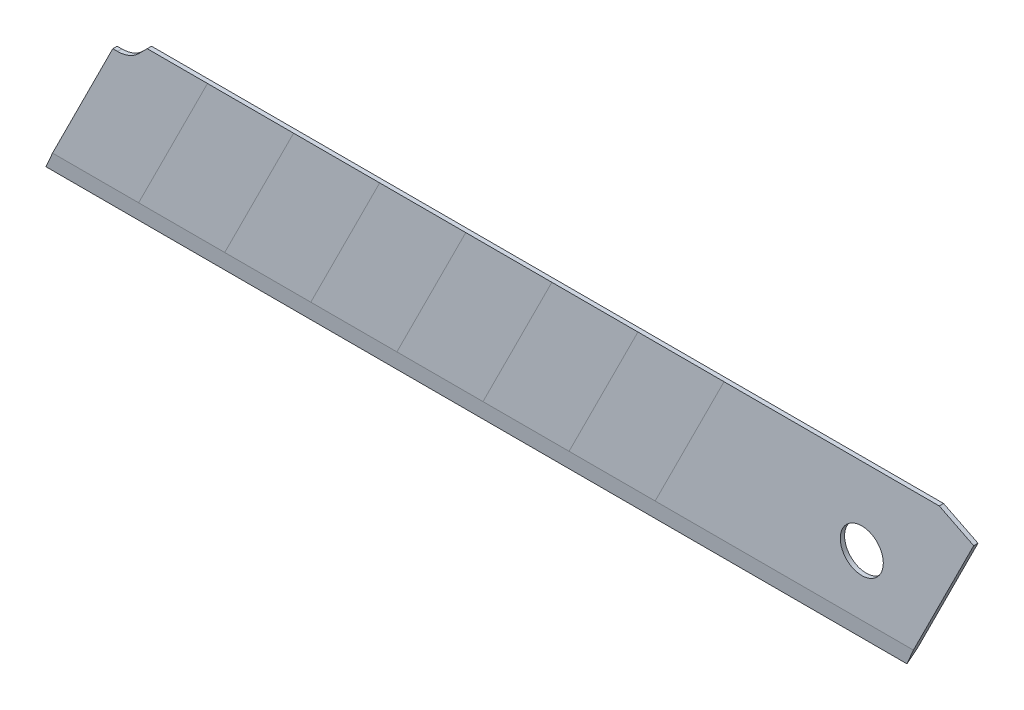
from build123d import *

# Parameters (mm, degrees)
ESQUISSE1_R             = 2.5
BOSS_EXTRU_1_DEPTH      = 0.5
ENL_V_MAT_EXTRU_1_DEPTH = 111.477373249
CHANFREIN2_SIZE         = 0.24
CHANFREIN2_SIZE2        = 2


with BuildPart() as part:
    # Esquisse1 → Boss.-Extru.1 (new body)
    with BuildSketch(Plane.XY):
        Polygon((0, 0), (9, 18), (109, 18), (100, 0), align=None)
        with Locations((95, 9)):
            Circle(ESQUISSE1_R, mode=Mode.SUBTRACT)
    extrude(amount=BOSS_EXTRU_1_DEPTH)

    # Esquisse2 → Enl_v. mat.-Extru.1 (cut, through all)
    with BuildSketch(Plane.XY.offset(0.5)):
        Polygon((104, 18), (108, 16), (109, 18), align=None)
        with BuildLine():
            Line((8, 16), (8.550252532, 16))
            ThreePointArc((8.550252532, 16), (9.889644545, 16.266421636), (11.025126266, 17.025126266))
            Line((11.025126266, 17.025126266), (12, 18))
            Line((12, 18), (9, 18))
            Line((9, 18), (8, 16))
        make_face()
    extrude(amount=-ENL_V_MAT_EXTRU_1_DEPTH, mode=Mode.SUBTRACT)

    # Chanfrein2
    chanfrein2_edges = [part.edges().sort_by_distance(p)[0] for p in [
        (50, 0, 0.5),
        (50, 0, 0),
    ]]
    chanfrein2_side = [part.faces().sort_by_distance(p)[0] for p in [
        (50, 0, 0.25),
    ]]
    chamfer(chanfrein2_edges, length=CHANFREIN2_SIZE, length2=CHANFREIN2_SIZE2, reference=chanfrein2_side[0])


solid = part.part
